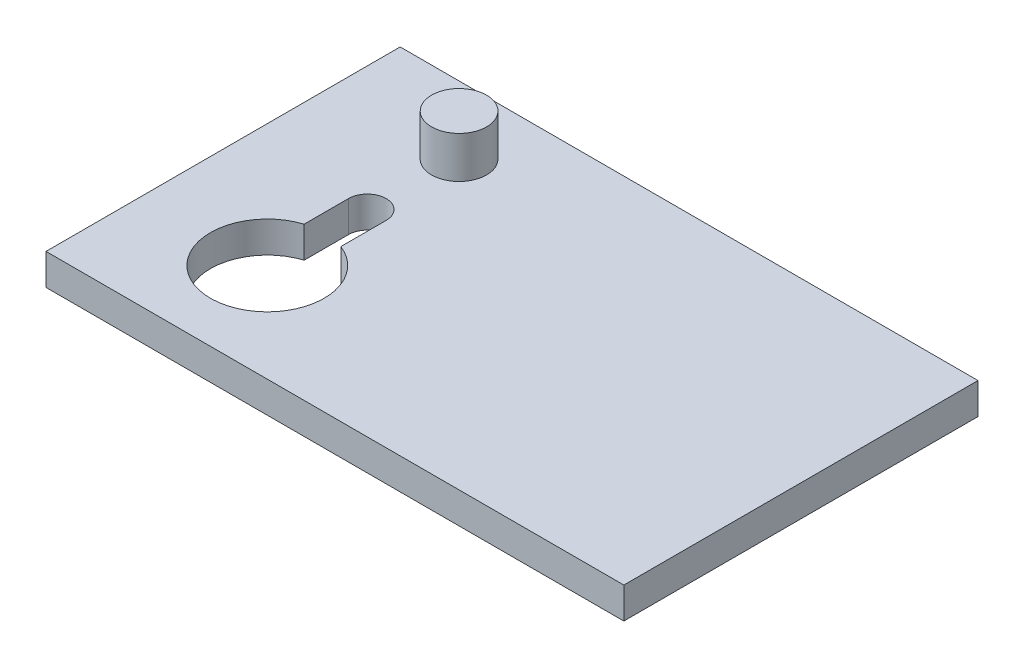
from build123d import *

# Parameters (mm, degrees)
SKETCH1_W          = 140.940304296
SKETCH1_H          = 86.38276715
EXTRUDE1_DEPTH     = 7.62
CUT_EXTRUDE1_DEPTH = 84.003628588
SKETCH3_R          = 6.70951587
EXTRUDE2_DEPTH     = 10.16


with BuildPart() as part:
    # Sketch1 → Extrude1 (new body)
    with BuildSketch(Plane(origin=(0, 0, 0), x_dir=(1, 0, 0), z_dir=(0, 1, 0))):
        Rectangle(SKETCH1_W, SKETCH1_H)
    extrude(amount=EXTRUDE1_DEPTH)

    # Sketch2 → Cut-Extrude1 (cut, through all)
    with BuildSketch(Plane(origin=(0, 7.62, 0), x_dir=(-1, 0, 0), z_dir=(0, 1, 0))):
        with BuildLine():
            Line((35.533598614, -4.857710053), (35.533598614, 6.215630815))
            ThreePointArc((35.533598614, 6.215630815), (40.910148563, 33.036624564), (44.74351916, 5.951974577))
            Line((44.74351916, 5.951974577), (44.74351916, -4.857710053))
            ThreePointArc((44.74351916, -4.857710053), (40.138558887, -9.462670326), (35.533598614, -4.857710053))
        make_face()
    extrude(amount=-CUT_EXTRUDE1_DEPTH, mode=Mode.SUBTRACT)

    # Sketch3 → Extrude2 (add)
    with BuildSketch(Plane(origin=(0, 7.62, 0), x_dir=(-1, 0, 0), z_dir=(0, 1, 0))):
        with Locations(Location((39.59006219, -26.684050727, 0), (0, 0, 90))):
            Circle(SKETCH3_R)
    extrude(amount=EXTRUDE2_DEPTH)


solid = part.part
